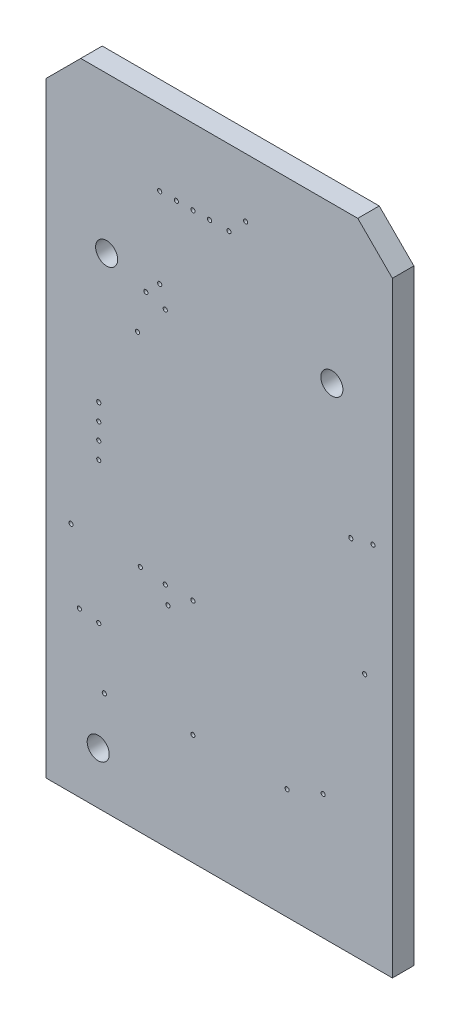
from build123d import *

# Parameters (mm, degrees)
BOARD_OUTLINE_DEPTH = 0.7874
SKETCH2_R           = 0.0762
NPTH_DEPTH          = 27.719375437
SKETCH3_R           = 0.405
PTH_DEPTH           = 27.719375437


with BuildPart() as part:
    # Sketch1 → Board_Outline (new body)
    with BuildSketch(Plane.XY):
        Polygon((0, 0), (0, 22.225), (1.27, 23.495), (11.43, 23.495), (12.7, 22.225), (12.7, 0), align=None)
    extrude(amount=BOARD_OUTLINE_DEPTH)

    # Sketch2 → NPTH (cut, through all)
    with BuildSketch(Plane.XY):
        with Locations((1.2192, 5.9944)):
            Circle(SKETCH2_R)
        with Locations((10.16, 4.572)):
            Circle(SKETCH2_R)
        with Locations((11.684, 9.144)):
            Circle(SKETCH2_R)
        with Locations((4.3688, 8.3312)):
            Circle(SKETCH2_R)
        with Locations((1.9304, 11.684)):
            Circle(SKETCH2_R)
        with Locations((7.3152, 21.336)):
            Circle(SKETCH2_R)
        with Locations((6.7056, 20.7264)):
            Circle(SKETCH2_R)
        with Locations((11.176, 13.208)):
            Circle(SKETCH2_R)
        with Locations((3.4544, 8.4328)):
            Circle(SKETCH2_R)
        with Locations((2.1336, 3.7592)):
            Circle(SKETCH2_R)
        with Locations((4.4704, 7.7216)):
            Circle(SKETCH2_R)
        with Locations((8.8392, 4.064)):
            Circle(SKETCH2_R)
        with Locations((5.3848, 20.7264)):
            Circle(SKETCH2_R)
        with Locations((3.3528, 15.8496)):
            Circle(SKETCH2_R)
        with Locations((4.7752, 20.7264)):
            Circle(SKETCH2_R)
        with Locations((4.3688, 17.0688)):
            Circle(SKETCH2_R)
        with Locations((4.1656, 20.7264)):
            Circle(SKETCH2_R)
        with Locations((4.1656, 17.78)):
            Circle(SKETCH2_R)
        with Locations((5.9944, 20.7264)):
            Circle(SKETCH2_R)
        with Locations((3.6576, 17.272)):
            Circle(SKETCH2_R)
        with Locations((5.3848, 8.3312)):
            Circle(SKETCH2_R)
        with Locations((5.3848, 4.064)):
            Circle(SKETCH2_R)
        with Locations((1.9304, 12.2936)):
            Circle(SKETCH2_R)
        with Locations((1.9304, 5.8928)):
            Circle(SKETCH2_R)
        with Locations((0.9144, 8.5344)):
            Circle(SKETCH2_R)
        with Locations((1.9304, 12.9032)):
            Circle(SKETCH2_R)
        with Locations((1.9304, 11.0744)):
            Circle(SKETCH2_R)
        with Locations((11.9888, 13.4112)):
            Circle(SKETCH2_R)
    extrude(amount=NPTH_DEPTH, mode=Mode.SUBTRACT)

    # Sketch3 → PTH (cut, through all)
    with BuildSketch(Plane.XY):
        with Locations((2.22, 17.78)):
            Circle(SKETCH3_R)
        with Locations((10.48, 17.78)):
            Circle(SKETCH3_R)
        with Locations((1.91, 1.91)):
            Circle(SKETCH3_R)
    extrude(amount=PTH_DEPTH, mode=Mode.SUBTRACT)


solid = part.part
